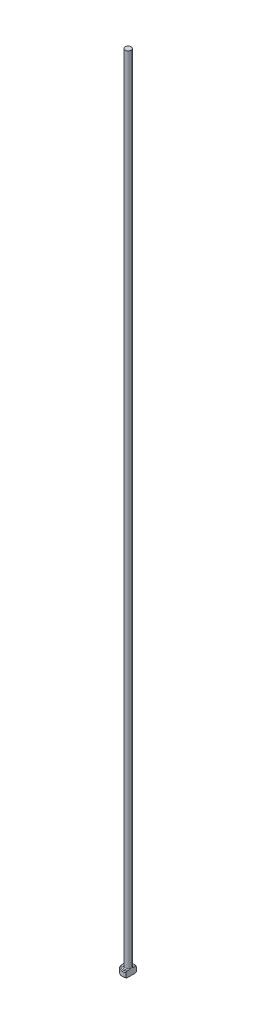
from build123d import *
from build123d.topology import SkipClean

# Parameters (mm, degrees)
CHAMFER1_SIZE = 0.2
FILLET1_R     = 0.2
KEY_DEPTH     = 201.011249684


with BuildPart() as part:
    # Sketch1 → Revolve1 (revolve)
    with BuildSketch(Plane.XY, mode=Mode.PRIVATE) as revolve1_sk:
        Polygon((0, 0), (-1.5, 0), (-1.5, 1.5), (-0.75, 1.5), (-0.75, 200), (0, 200), align=None)
    revolve(revolve1_sk.sketch.rotate(Axis((0, 259.958771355, 0), (0, -1, 0)), 270), axis=Axis((0, 259.958771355, 0), (0, -1, 0)))

    # Chamfer1
    chamfer1_edges = [part.edges().sort_by_distance(p)[0] for p in [
        (0, 1.5, -1.5),
        (0, 0, -1.5),
    ]]
    chamfer(chamfer1_edges, length=CHAMFER1_SIZE)

    # Fillet1
    fillet1_edges = [part.edges().sort_by_distance(p)[0] for p in [
        (0, 1.5, -0.75),
    ]]
    fillet(fillet1_edges, radius=FILLET1_R)

    # Sketch2 → KEY (cut, through all)
    with SkipClean():  # the faces are left unmerged after this step: merging them gives an invalid solid
        with BuildSketch(Plane(origin=(0, 0, 0), x_dir=(1, 0, 0), z_dir=(0, 1, 0))):
            with BuildLine():
                Line((0.75, 1.299038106), (0.75, -1.299038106))
                ThreePointArc((0.75, -1.299038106), (1.5, 0), (0.75, 1.299038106))
            make_face()
        extrude(amount=KEY_DEPTH, mode=Mode.SUBTRACT)


solid = part.part
